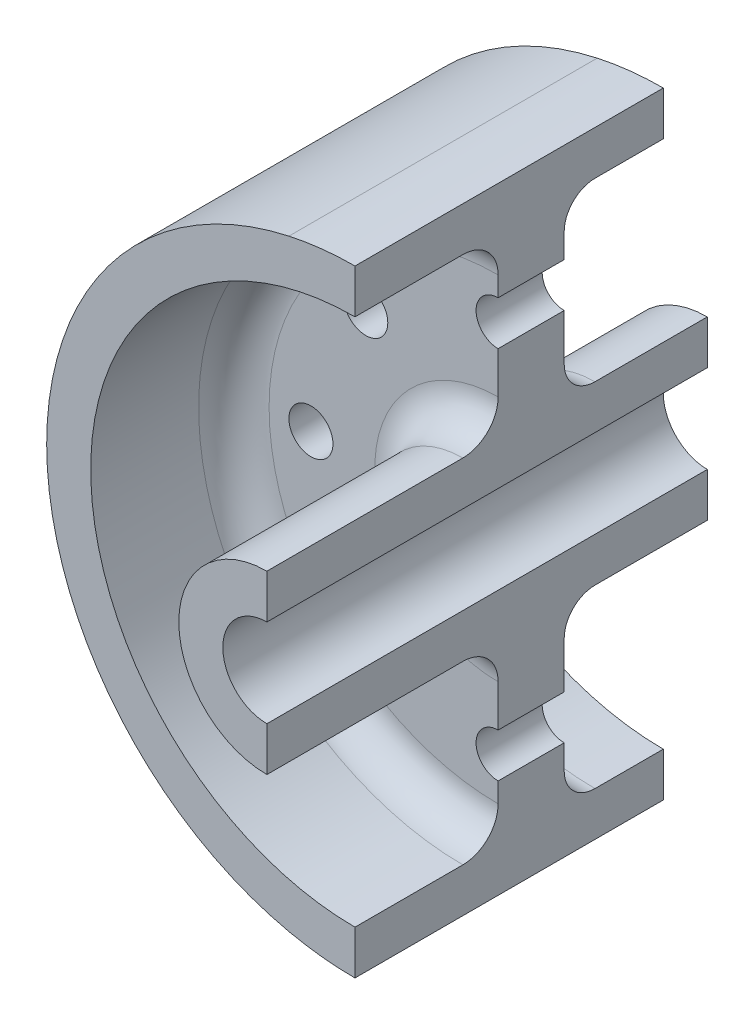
ISO-10303-21;
HEADER;
FILE_DESCRIPTION(('STEP AP214'),'2;1');
FILE_NAME('part.step','',(''),(''),'','','');
FILE_SCHEMA(('AUTOMOTIVE_DESIGN { 1 0 10303 214 1 1 1 1 }'));
ENDSEC;
DATA;
#1=APPLICATION_CONTEXT('core data for automotive mechanical design processes');
#2=APPLICATION_PROTOCOL_DEFINITION('international standard','automotive_design',2000,#1);
#3=PRODUCT_CONTEXT('',#1,'mechanical');
#4=PRODUCT('Part','Part','',(#3));
#5=PRODUCT_RELATED_PRODUCT_CATEGORY('part','',(#4));
#6=PRODUCT_DEFINITION_FORMATION('','',#4);
#7=PRODUCT_DEFINITION_CONTEXT('part definition',#1,'design');
#8=PRODUCT_DEFINITION('design','',#6,#7);
#9=PRODUCT_DEFINITION_SHAPE('','',#8);
#10=(LENGTH_UNIT() NAMED_UNIT(*) SI_UNIT(.MILLI.,.METRE.));
#11=(NAMED_UNIT(*) PLANE_ANGLE_UNIT() SI_UNIT($,.RADIAN.));
#12=(NAMED_UNIT(*) SI_UNIT($,.STERADIAN.) SOLID_ANGLE_UNIT());
#13=UNCERTAINTY_MEASURE_WITH_UNIT(LENGTH_MEASURE(1.E-05),#10,'distance_accuracy_value','');
#14=(GEOMETRIC_REPRESENTATION_CONTEXT(3) GLOBAL_UNCERTAINTY_ASSIGNED_CONTEXT((#13)) GLOBAL_UNIT_ASSIGNED_CONTEXT((#10,
#11,#12)) REPRESENTATION_CONTEXT('',''));
#15=CARTESIAN_POINT('',(0.,0.,0.));
#16=DIRECTION('',(0.,0.,1.));
#17=DIRECTION('',(1.,0.,0.));
#18=AXIS2_PLACEMENT_3D('',#15,#16,#17);
#19=CARTESIAN_POINT('',(0.,0.,0.));
#20=DIRECTION('',(0.,0.,1.));
#21=DIRECTION('',(1.,0.,0.));
#22=AXIS2_PLACEMENT_3D('',#19,#20,#21);
#23=CYLINDRICAL_SURFACE('',#22,177.8);
#24=CARTESIAN_POINT('',(0.,0.,-50.8));
#25=DIRECTION('',(0.,0.,1.));
#26=DIRECTION('',(1.,0.,0.));
#27=AXIS2_PLACEMENT_3D('',#24,#25,#26);
#28=CIRCLE('',#27,177.8);
#29=CARTESIAN_POINT('',(0.,177.8,-50.8));
#30=VERTEX_POINT('',#29);
#31=CARTESIAN_POINT('',(-38.1,173.669888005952,-50.8));
#32=VERTEX_POINT('',#31);
#33=EDGE_CURVE('E215',#30,#32,#28,.T.);
#34=ORIENTED_EDGE('',*,*,#33,.F.);
#35=DIRECTION('',(0.,0.,1.));
#36=VECTOR('',#35,1.);
#37=CARTESIAN_POINT('',(0.,177.8,0.));
#38=LINE('',#37,#36);
#39=CARTESIAN_POINT('',(0.,177.8,-228.6));
#40=VERTEX_POINT('',#39);
#41=EDGE_CURVE('E329',#30,#40,#38,.F.);
#42=ORIENTED_EDGE('',*,*,#41,.T.);
#43=CARTESIAN_POINT('',(0.,0.,-228.6));
#44=DIRECTION('',(0.,0.,1.));
#45=DIRECTION('',(1.,0.,0.));
#46=AXIS2_PLACEMENT_3D('',#43,#44,#45);
#47=CIRCLE('',#46,177.8);
#48=CARTESIAN_POINT('',(-38.1,173.669888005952,-228.6));
#49=VERTEX_POINT('',#48);
#50=EDGE_CURVE('E225',#40,#49,#47,.T.);
#51=ORIENTED_EDGE('',*,*,#50,.T.);
#52=DIRECTION('',(0.,0.,1.));
#53=VECTOR('',#52,1.);
#54=CARTESIAN_POINT('',(-38.1,173.669888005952,0.));
#55=LINE('',#54,#53);
#56=EDGE_CURVE('E284',#49,#32,#55,.T.);
#57=ORIENTED_EDGE('',*,*,#56,.T.);
#58=EDGE_LOOP('',(#34,#42,#51,#57));
#59=FACE_BOUND('',#58,.T.);
#60=ADVANCED_FACE('F36',(#59),#23,.T.);
#61=CARTESIAN_POINT('',(-38.1,-173.669888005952,-228.6));
#62=VERTEX_POINT('',#61);
#63=CARTESIAN_POINT('',(0.,-177.8,-228.6));
#64=VERTEX_POINT('',#63);
#65=EDGE_CURVE('E231',#62,#64,#47,.T.);
#66=ORIENTED_EDGE('',*,*,#65,.T.);
#67=DIRECTION('',(0.,0.,1.));
#68=VECTOR('',#67,1.);
#69=CARTESIAN_POINT('',(0.,-177.8,0.));
#70=LINE('',#69,#68);
#71=CARTESIAN_POINT('',(0.,-177.8,-50.8));
#72=VERTEX_POINT('',#71);
#73=EDGE_CURVE('E351',#64,#72,#70,.T.);
#74=ORIENTED_EDGE('',*,*,#73,.T.);
#75=CARTESIAN_POINT('',(-38.1,-173.669888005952,-50.8));
#76=VERTEX_POINT('',#75);
#77=EDGE_CURVE('E226',#76,#72,#28,.T.);
#78=ORIENTED_EDGE('',*,*,#77,.F.);
#79=DIRECTION('',(0.,0.,1.));
#80=VECTOR('',#79,1.);
#81=CARTESIAN_POINT('',(-38.1,-173.669888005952,0.));
#82=LINE('',#81,#80);
#83=EDGE_CURVE('E283',#76,#62,#82,.F.);
#84=ORIENTED_EDGE('',*,*,#83,.T.);
#85=EDGE_LOOP('',(#66,#74,#78,#84));
#86=FACE_BOUND('',#85,.T.);
#87=ADVANCED_FACE('F392',(#86),#23,.T.);
#88=ORIENTED_EDGE('',*,*,#56,.F.);
#89=EDGE_CURVE('E227',#49,#62,#47,.T.);
#90=ORIENTED_EDGE('',*,*,#89,.T.);
#91=ORIENTED_EDGE('',*,*,#83,.F.);
#92=EDGE_CURVE('E222',#32,#76,#28,.T.);
#93=ORIENTED_EDGE('',*,*,#92,.F.);
#94=EDGE_LOOP('',(#88,#90,#91,#93));
#95=FACE_BOUND('',#94,.T.);
#96=ADVANCED_FACE('F395',(#95),#23,.T.);
#97=CARTESIAN_POINT('',(0.,50.8,0.));
#98=DIRECTION('',(0.,0.,-1.));
#99=DIRECTION('',(-1.,0.,0.));
#100=AXIS2_PLACEMENT_3D('',#97,#98,#99);
#101=PLANE('',#100);
#102=CARTESIAN_POINT('',(0.,0.,0.));
#103=DIRECTION('',(0.,0.,1.));
#104=DIRECTION('',(1.,0.,0.));
#105=AXIS2_PLACEMENT_3D('',#102,#103,#104);
#106=CIRCLE('',#105,50.8);
#107=CARTESIAN_POINT('',(0.,50.8,0.));
#108=VERTEX_POINT('',#107);
#109=CARTESIAN_POINT('',(0.,-50.8,0.));
#110=VERTEX_POINT('',#109);
#111=EDGE_CURVE('E202',#108,#110,#106,.T.);
#112=ORIENTED_EDGE('',*,*,#111,.T.);
#113=DIRECTION('',(0.,-1.,0.));
#114=VECTOR('',#113,1.);
#115=CARTESIAN_POINT('',(0.,-194.939137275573,0.));
#116=LINE('',#115,#114);
#117=CARTESIAN_POINT('',(0.,-25.4,0.));
#118=VERTEX_POINT('',#117);
#119=EDGE_CURVE('E206',#118,#110,#116,.T.);
#120=ORIENTED_EDGE('',*,*,#119,.F.);
#121=CARTESIAN_POINT('',(0.,0.,0.));
#122=DIRECTION('',(0.,0.,1.));
#123=DIRECTION('',(1.,0.,0.));
#124=AXIS2_PLACEMENT_3D('',#121,#122,#123);
#125=CIRCLE('',#124,25.4);
#126=CARTESIAN_POINT('',(0.,25.4,0.));
#127=VERTEX_POINT('',#126);
#128=EDGE_CURVE('E204',#127,#118,#125,.T.);
#129=ORIENTED_EDGE('',*,*,#128,.F.);
#130=EDGE_CURVE('E187',#108,#127,#116,.T.);
#131=ORIENTED_EDGE('',*,*,#130,.F.);
#132=EDGE_LOOP('',(#112,#120,#129,#131));
#133=FACE_BOUND('',#132,.T.);
#134=ADVANCED_FACE('F200',(#133),#101,.F.);
#135=CARTESIAN_POINT('',(0.,0.,0.));
#136=DIRECTION('',(0.,0.,1.));
#137=DIRECTION('',(1.,0.,0.));
#138=AXIS2_PLACEMENT_3D('',#135,#136,#137);
#139=CYLINDRICAL_SURFACE('',#138,25.4);
#140=ORIENTED_EDGE('',*,*,#128,.T.);
#141=DIRECTION('',(0.,0.,1.));
#142=VECTOR('',#141,1.);
#143=CARTESIAN_POINT('',(0.,-25.4,0.));
#144=LINE('',#143,#142);
#145=CARTESIAN_POINT('',(0.,-25.4,-254.));
#146=VERTEX_POINT('',#145);
#147=EDGE_CURVE('E260',#118,#146,#144,.F.);
#148=ORIENTED_EDGE('',*,*,#147,.T.);
#149=CARTESIAN_POINT('',(0.,0.,-254.));
#150=DIRECTION('',(0.,0.,1.));
#151=DIRECTION('',(1.,0.,0.));
#152=AXIS2_PLACEMENT_3D('',#149,#150,#151);
#153=CIRCLE('',#152,25.4);
#154=CARTESIAN_POINT('',(0.,25.4,-254.));
#155=VERTEX_POINT('',#154);
#156=EDGE_CURVE('E237',#155,#146,#153,.T.);
#157=ORIENTED_EDGE('',*,*,#156,.F.);
#158=DIRECTION('',(0.,0.,1.));
#159=VECTOR('',#158,1.);
#160=CARTESIAN_POINT('',(0.,25.4,0.));
#161=LINE('',#160,#159);
#162=EDGE_CURVE('E360',#155,#127,#161,.T.);
#163=ORIENTED_EDGE('',*,*,#162,.T.);
#164=EDGE_LOOP('',(#140,#148,#157,#163));
#165=FACE_BOUND('',#164,.T.);
#166=ADVANCED_FACE('F408',(#165),#139,.F.);
#167=CARTESIAN_POINT('',(0.,25.4,-254.));
#168=DIRECTION('',(0.,0.,1.));
#169=DIRECTION('',(1.,0.,0.));
#170=AXIS2_PLACEMENT_3D('',#167,#168,#169);
#171=PLANE('',#170);
#172=CARTESIAN_POINT('',(0.,0.,-254.));
#173=DIRECTION('',(0.,0.,1.));
#174=DIRECTION('',(1.,0.,0.));
#175=AXIS2_PLACEMENT_3D('',#172,#173,#174);
#176=CIRCLE('',#175,50.8);
#177=CARTESIAN_POINT('',(0.,50.8,-254.));
#178=VERTEX_POINT('',#177);
#179=CARTESIAN_POINT('',(0.,-50.8,-254.));
#180=VERTEX_POINT('',#179);
#181=EDGE_CURVE('E234',#178,#180,#176,.T.);
#182=ORIENTED_EDGE('',*,*,#181,.F.);
#183=DIRECTION('',(0.,-1.,0.));
#184=VECTOR('',#183,1.);
#185=CARTESIAN_POINT('',(0.,-194.939137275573,-254.));
#186=LINE('',#185,#184);
#187=EDGE_CURVE('E447',#178,#155,#186,.T.);
#188=ORIENTED_EDGE('',*,*,#187,.T.);
#189=ORIENTED_EDGE('',*,*,#156,.T.);
#190=EDGE_CURVE('E205',#146,#180,#186,.T.);
#191=ORIENTED_EDGE('',*,*,#190,.T.);
#192=EDGE_LOOP('',(#182,#188,#189,#191));
#193=FACE_BOUND('',#192,.T.);
#194=ADVANCED_FACE('F452',(#193),#171,.F.);
#195=CARTESIAN_POINT('',(0.,0.,0.));
#196=DIRECTION('',(0.,0.,1.));
#197=DIRECTION('',(1.,0.,0.));
#198=AXIS2_PLACEMENT_3D('',#195,#196,#197);
#199=CYLINDRICAL_SURFACE('',#198,50.8);
#200=ORIENTED_EDGE('',*,*,#181,.T.);
#201=DIRECTION('',(0.,0.,1.));
#202=VECTOR('',#201,1.);
#203=CARTESIAN_POINT('',(0.,-50.8,0.));
#204=LINE('',#203,#202);
#205=CARTESIAN_POINT('',(0.,-50.8,-189.23));
#206=VERTEX_POINT('',#205);
#207=EDGE_CURVE('E300',#180,#206,#204,.T.);
#208=ORIENTED_EDGE('',*,*,#207,.T.);
#209=CARTESIAN_POINT('',(0.,0.,-189.23));
#210=DIRECTION('',(0.,0.,1.));
#211=DIRECTION('',(1.,0.,0.));
#212=AXIS2_PLACEMENT_3D('',#209,#210,#211);
#213=CIRCLE('',#212,50.8);
#214=CARTESIAN_POINT('',(0.,50.8,-189.23));
#215=VERTEX_POINT('',#214);
#216=EDGE_CURVE('E280',#206,#215,#213,.F.);
#217=ORIENTED_EDGE('',*,*,#216,.T.);
#218=DIRECTION('',(0.,0.,1.));
#219=VECTOR('',#218,1.);
#220=CARTESIAN_POINT('',(0.,50.8,0.));
#221=LINE('',#220,#219);
#222=EDGE_CURVE('E298',#215,#178,#221,.F.);
#223=ORIENTED_EDGE('',*,*,#222,.T.);
#224=EDGE_LOOP('',(#200,#208,#217,#223));
#225=FACE_BOUND('',#224,.T.);
#226=ADVANCED_FACE('F297',(#225),#199,.T.);
#227=CARTESIAN_POINT('',(0.,152.4,-171.45));
#228=DIRECTION('',(0.,0.,1.));
#229=DIRECTION('',(1.,0.,0.));
#230=AXIS2_PLACEMENT_3D('',#227,#228,#229);
#231=PLANE('',#230);
#232=CARTESIAN_POINT('',(-76.3321770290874,-76.3321770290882,-171.45));
#233=DIRECTION('',(0.,0.,1.));
#234=DIRECTION('',(1.,0.,0.));
#235=AXIS2_PLACEMENT_3D('',#232,#233,#234);
#236=CIRCLE('',#235,12.7);
#237=CARTESIAN_POINT('',(-63.6321770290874,-76.3321770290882,-171.45));
#238=VERTEX_POINT('',#237);
#239=EDGE_CURVE('E252',#238,#238,#236,.T.);
#240=ORIENTED_EDGE('',*,*,#239,.T.);
#241=EDGE_LOOP('',(#240));
#242=FACE_BOUND('',#241,.T.);
#243=CARTESIAN_POINT('',(-107.95,-3.76905628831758E-13,-171.45));
#244=DIRECTION('',(0.,0.,1.));
#245=DIRECTION('',(1.,0.,0.));
#246=AXIS2_PLACEMENT_3D('',#243,#244,#245);
#247=CIRCLE('',#246,12.7);
#248=CARTESIAN_POINT('',(-95.25,-3.76905628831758E-13,-171.45));
#249=VERTEX_POINT('',#248);
#250=EDGE_CURVE('E248',#249,#249,#247,.T.);
#251=ORIENTED_EDGE('',*,*,#250,.T.);
#252=EDGE_LOOP('',(#251));
#253=FACE_BOUND('',#252,.T.);
#254=CARTESIAN_POINT('',(-76.3321770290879,76.3321770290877,-171.45));
#255=DIRECTION('',(0.,0.,1.));
#256=DIRECTION('',(1.,0.,0.));
#257=AXIS2_PLACEMENT_3D('',#254,#255,#256);
#258=CIRCLE('',#257,12.7);
#259=CARTESIAN_POINT('',(-63.6321770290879,76.3321770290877,-171.45));
#260=VERTEX_POINT('',#259);
#261=EDGE_CURVE('E244',#260,#260,#258,.T.);
#262=ORIENTED_EDGE('',*,*,#261,.T.);
#263=EDGE_LOOP('',(#262));
#264=FACE_BOUND('',#263,.T.);
#265=CARTESIAN_POINT('',(0.,0.,-171.45));
#266=DIRECTION('',(0.,0.,1.));
#267=DIRECTION('',(1.,0.,0.));
#268=AXIS2_PLACEMENT_3D('',#265,#266,#267);
#269=CIRCLE('',#268,134.62);
#270=CARTESIAN_POINT('',(0.,-134.62,-171.45));
#271=VERTEX_POINT('',#270);
#272=CARTESIAN_POINT('',(0.,134.62,-171.45));
#273=VERTEX_POINT('',#272);
#274=EDGE_CURVE('E274',#271,#273,#269,.F.);
#275=ORIENTED_EDGE('',*,*,#274,.T.);
#276=DIRECTION('',(0.,-1.,0.));
#277=VECTOR('',#276,1.);
#278=CARTESIAN_POINT('',(0.,152.4,-171.45));
#279=LINE('',#278,#277);
#280=CARTESIAN_POINT('',(0.,120.65,-171.45));
#281=VERTEX_POINT('',#280);
#282=EDGE_CURVE('E59',#273,#281,#279,.T.);
#283=ORIENTED_EDGE('',*,*,#282,.T.);
#284=CARTESIAN_POINT('',(0.,107.95,-171.45));
#285=DIRECTION('',(0.,0.,1.));
#286=DIRECTION('',(1.,0.,0.));
#287=AXIS2_PLACEMENT_3D('',#284,#285,#286);
#288=CIRCLE('',#287,12.7);
#289=CARTESIAN_POINT('',(0.,95.25,-171.45));
#290=VERTEX_POINT('',#289);
#291=EDGE_CURVE('E212',#281,#290,#288,.T.);
#292=ORIENTED_EDGE('',*,*,#291,.T.);
#293=CARTESIAN_POINT('',(0.,68.58,-171.45));
#294=VERTEX_POINT('',#293);
#295=EDGE_CURVE('E310',#290,#294,#279,.T.);
#296=ORIENTED_EDGE('',*,*,#295,.T.);
#297=CARTESIAN_POINT('',(0.,0.,-171.45));
#298=DIRECTION('',(0.,0.,1.));
#299=DIRECTION('',(1.,0.,0.));
#300=AXIS2_PLACEMENT_3D('',#297,#298,#299);
#301=CIRCLE('',#300,68.58);
#302=CARTESIAN_POINT('',(0.,-68.58,-171.45));
#303=VERTEX_POINT('',#302);
#304=EDGE_CURVE('E277',#294,#303,#301,.T.);
#305=ORIENTED_EDGE('',*,*,#304,.T.);
#306=CARTESIAN_POINT('',(0.,-95.25,-171.45));
#307=VERTEX_POINT('',#306);
#308=EDGE_CURVE('E195',#303,#307,#279,.T.);
#309=ORIENTED_EDGE('',*,*,#308,.T.);
#310=CARTESIAN_POINT('',(7.53811257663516E-13,-107.95,-171.45));
#311=DIRECTION('',(0.,0.,1.));
#312=DIRECTION('',(1.,0.,0.));
#313=AXIS2_PLACEMENT_3D('',#310,#311,#312);
#314=CIRCLE('',#313,12.7);
#315=CARTESIAN_POINT('',(0.,-120.65,-171.45));
#316=VERTEX_POINT('',#315);
#317=EDGE_CURVE('E256',#307,#316,#314,.T.);
#318=ORIENTED_EDGE('',*,*,#317,.T.);
#319=EDGE_CURVE('E346',#316,#271,#279,.T.);
#320=ORIENTED_EDGE('',*,*,#319,.T.);
#321=EDGE_LOOP('',(#275,#283,#292,#296,#305,#309,#318,#320));
#322=FACE_BOUND('',#321,.T.);
#323=ADVANCED_FACE('F372',(#242,#253,#264,#322),#231,.F.);
#324=CARTESIAN_POINT('',(0.,0.,0.));
#325=DIRECTION('',(0.,0.,1.));
#326=DIRECTION('',(1.,0.,0.));
#327=AXIS2_PLACEMENT_3D('',#324,#325,#326);
#328=CYLINDRICAL_SURFACE('',#327,152.4);
#329=CARTESIAN_POINT('',(0.,0.,-189.23));
#330=DIRECTION('',(0.,0.,1.));
#331=DIRECTION('',(1.,0.,0.));
#332=AXIS2_PLACEMENT_3D('',#329,#330,#331);
#333=CIRCLE('',#332,152.4);
#334=CARTESIAN_POINT('',(0.,152.4,-189.23));
#335=VERTEX_POINT('',#334);
#336=CARTESIAN_POINT('',(0.,-152.4,-189.23));
#337=VERTEX_POINT('',#336);
#338=EDGE_CURVE('E271',#335,#337,#333,.T.);
#339=ORIENTED_EDGE('',*,*,#338,.T.);
#340=DIRECTION('',(0.,0.,1.));
#341=VECTOR('',#340,1.);
#342=CARTESIAN_POINT('',(0.,-152.4,0.));
#343=LINE('',#342,#341);
#344=CARTESIAN_POINT('',(0.,-152.4,-228.6));
#345=VERTEX_POINT('',#344);
#346=EDGE_CURVE('E51',#337,#345,#343,.F.);
#347=ORIENTED_EDGE('',*,*,#346,.T.);
#348=CARTESIAN_POINT('',(0.,0.,-228.6));
#349=DIRECTION('',(0.,0.,1.));
#350=DIRECTION('',(1.,0.,0.));
#351=AXIS2_PLACEMENT_3D('',#348,#349,#350);
#352=CIRCLE('',#351,152.4);
#353=CARTESIAN_POINT('',(0.,152.4,-228.6));
#354=VERTEX_POINT('',#353);
#355=EDGE_CURVE('E230',#354,#345,#352,.T.);
#356=ORIENTED_EDGE('',*,*,#355,.F.);
#357=DIRECTION('',(0.,0.,1.));
#358=VECTOR('',#357,1.);
#359=CARTESIAN_POINT('',(0.,152.4,0.));
#360=LINE('',#359,#358);
#361=EDGE_CURVE('E319',#354,#335,#360,.T.);
#362=ORIENTED_EDGE('',*,*,#361,.T.);
#363=EDGE_LOOP('',(#339,#347,#356,#362));
#364=FACE_BOUND('',#363,.T.);
#365=ADVANCED_FACE('F468',(#364),#328,.F.);
#366=CARTESIAN_POINT('',(0.,177.8,-228.6));
#367=DIRECTION('',(0.,0.,1.));
#368=DIRECTION('',(1.,0.,0.));
#369=AXIS2_PLACEMENT_3D('',#366,#367,#368);
#370=PLANE('',#369);
#371=ORIENTED_EDGE('',*,*,#50,.F.);
#372=DIRECTION('',(0.,-1.,0.));
#373=VECTOR('',#372,1.);
#374=CARTESIAN_POINT('',(0.,177.8,-228.6));
#375=LINE('',#374,#373);
#376=EDGE_CURVE('E326',#40,#354,#375,.T.);
#377=ORIENTED_EDGE('',*,*,#376,.T.);
#378=ORIENTED_EDGE('',*,*,#355,.T.);
#379=EDGE_CURVE('E330',#345,#64,#375,.T.);
#380=ORIENTED_EDGE('',*,*,#379,.T.);
#381=ORIENTED_EDGE('',*,*,#65,.F.);
#382=ORIENTED_EDGE('',*,*,#89,.F.);
#383=EDGE_LOOP('',(#371,#377,#378,#380,#381,#382));
#384=FACE_BOUND('',#383,.T.);
#385=ADVANCED_FACE('F416',(#384),#370,.F.);
#386=CARTESIAN_POINT('',(0.,152.4,-50.8));
#387=DIRECTION('',(0.,0.,-1.));
#388=DIRECTION('',(-1.,0.,0.));
#389=AXIS2_PLACEMENT_3D('',#386,#387,#388);
#390=PLANE('',#389);
#391=ORIENTED_EDGE('',*,*,#77,.T.);
#392=DIRECTION('',(0.,1.,0.));
#393=VECTOR('',#392,1.);
#394=CARTESIAN_POINT('',(0.,152.4,-50.8));
#395=LINE('',#394,#393);
#396=CARTESIAN_POINT('',(0.,-152.4,-50.8));
#397=VERTEX_POINT('',#396);
#398=EDGE_CURVE('E343',#72,#397,#395,.T.);
#399=ORIENTED_EDGE('',*,*,#398,.T.);
#400=CARTESIAN_POINT('',(0.,0.,-50.8));
#401=DIRECTION('',(0.,0.,1.));
#402=DIRECTION('',(1.,0.,0.));
#403=AXIS2_PLACEMENT_3D('',#400,#401,#402);
#404=CIRCLE('',#403,152.4);
#405=CARTESIAN_POINT('',(0.,152.4,-50.8));
#406=VERTEX_POINT('',#405);
#407=EDGE_CURVE('E211',#406,#397,#404,.T.);
#408=ORIENTED_EDGE('',*,*,#407,.F.);
#409=EDGE_CURVE('E339',#406,#30,#395,.T.);
#410=ORIENTED_EDGE('',*,*,#409,.T.);
#411=ORIENTED_EDGE('',*,*,#33,.T.);
#412=ORIENTED_EDGE('',*,*,#92,.T.);
#413=EDGE_LOOP('',(#391,#399,#408,#410,#411,#412));
#414=FACE_BOUND('',#413,.T.);
#415=ADVANCED_FACE('F423',(#414),#390,.F.);
#416=CARTESIAN_POINT('',(0.,0.,0.));
#417=DIRECTION('',(0.,0.,1.));
#418=DIRECTION('',(1.,0.,0.));
#419=AXIS2_PLACEMENT_3D('',#416,#417,#418);
#420=CYLINDRICAL_SURFACE('',#419,152.4);
#421=ORIENTED_EDGE('',*,*,#407,.T.);
#422=DIRECTION('',(0.,0.,1.));
#423=VECTOR('',#422,1.);
#424=CARTESIAN_POINT('',(0.,-152.4,0.));
#425=LINE('',#424,#423);
#426=CARTESIAN_POINT('',(0.,-152.4,-113.03));
#427=VERTEX_POINT('',#426);
#428=EDGE_CURVE('E357',#397,#427,#425,.F.);
#429=ORIENTED_EDGE('',*,*,#428,.T.);
#430=CARTESIAN_POINT('',(0.,0.,-113.03));
#431=DIRECTION('',(0.,0.,-1.));
#432=DIRECTION('',(-1.,0.,0.));
#433=AXIS2_PLACEMENT_3D('',#430,#431,#432);
#434=CIRCLE('',#433,152.4);
#435=CARTESIAN_POINT('',(0.,152.4,-113.03));
#436=VERTEX_POINT('',#435);
#437=EDGE_CURVE('E263',#427,#436,#434,.T.);
#438=ORIENTED_EDGE('',*,*,#437,.T.);
#439=DIRECTION('',(0.,0.,1.));
#440=VECTOR('',#439,1.);
#441=CARTESIAN_POINT('',(0.,152.4,0.));
#442=LINE('',#441,#440);
#443=EDGE_CURVE('E336',#436,#406,#442,.T.);
#444=ORIENTED_EDGE('',*,*,#443,.T.);
#445=EDGE_LOOP('',(#421,#429,#438,#444));
#446=FACE_BOUND('',#445,.T.);
#447=ADVANCED_FACE('F426',(#446),#420,.F.);
#448=CARTESIAN_POINT('',(0.,50.8,-133.35));
#449=DIRECTION('',(0.,0.,-1.));
#450=DIRECTION('',(-1.,0.,0.));
#451=AXIS2_PLACEMENT_3D('',#448,#449,#450);
#452=PLANE('',#451);
#453=CARTESIAN_POINT('',(0.,0.,-133.35));
#454=DIRECTION('',(0.,0.,-1.));
#455=DIRECTION('',(-1.,0.,0.));
#456=AXIS2_PLACEMENT_3D('',#453,#454,#455);
#457=CIRCLE('',#456,132.08);
#458=CARTESIAN_POINT('',(0.,132.08,-133.35));
#459=VERTEX_POINT('',#458);
#460=CARTESIAN_POINT('',(0.,-132.08,-133.35));
#461=VERTEX_POINT('',#460);
#462=EDGE_CURVE('E241',#459,#461,#457,.F.);
#463=ORIENTED_EDGE('',*,*,#462,.T.);
#464=DIRECTION('',(0.,1.,0.));
#465=VECTOR('',#464,1.);
#466=CARTESIAN_POINT('',(0.,50.8,-133.35));
#467=LINE('',#466,#465);
#468=CARTESIAN_POINT('',(0.,-120.65,-133.35));
#469=VERTEX_POINT('',#468);
#470=EDGE_CURVE('E350',#461,#469,#467,.T.);
#471=ORIENTED_EDGE('',*,*,#470,.T.);
#472=CARTESIAN_POINT('',(7.53811257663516E-13,-107.95,-133.35));
#473=DIRECTION('',(0.,0.,-1.));
#474=DIRECTION('',(-1.,0.,0.));
#475=AXIS2_PLACEMENT_3D('',#472,#473,#474);
#476=CIRCLE('',#475,12.7);
#477=CARTESIAN_POINT('',(0.,-95.25,-133.35));
#478=VERTEX_POINT('',#477);
#479=EDGE_CURVE('E257',#469,#478,#476,.T.);
#480=ORIENTED_EDGE('',*,*,#479,.T.);
#481=CARTESIAN_POINT('',(0.,-71.12,-133.35));
#482=VERTEX_POINT('',#481);
#483=EDGE_CURVE('E306',#478,#482,#467,.T.);
#484=ORIENTED_EDGE('',*,*,#483,.T.);
#485=CARTESIAN_POINT('',(0.,0.,-133.35));
#486=DIRECTION('',(0.,0.,-1.));
#487=DIRECTION('',(-1.,0.,0.));
#488=AXIS2_PLACEMENT_3D('',#485,#486,#487);
#489=CIRCLE('',#488,71.12);
#490=CARTESIAN_POINT('',(0.,71.12,-133.35));
#491=VERTEX_POINT('',#490);
#492=EDGE_CURVE('E268',#482,#491,#489,.T.);
#493=ORIENTED_EDGE('',*,*,#492,.T.);
#494=CARTESIAN_POINT('',(0.,95.25,-133.35));
#495=VERTEX_POINT('',#494);
#496=EDGE_CURVE('E440',#491,#495,#467,.T.);
#497=ORIENTED_EDGE('',*,*,#496,.T.);
#498=CARTESIAN_POINT('',(0.,107.95,-133.35));
#499=DIRECTION('',(0.,0.,-1.));
#500=DIRECTION('',(-1.,0.,0.));
#501=AXIS2_PLACEMENT_3D('',#498,#499,#500);
#502=CIRCLE('',#501,12.7);
#503=CARTESIAN_POINT('',(0.,120.65,-133.35));
#504=VERTEX_POINT('',#503);
#505=EDGE_CURVE('E218',#495,#504,#502,.T.);
#506=ORIENTED_EDGE('',*,*,#505,.T.);
#507=EDGE_CURVE('E325',#504,#459,#467,.T.);
#508=ORIENTED_EDGE('',*,*,#507,.T.);
#509=EDGE_LOOP('',(#463,#471,#480,#484,#493,#497,#506,#508));
#510=FACE_BOUND('',#509,.T.);
#511=CARTESIAN_POINT('',(-76.3321770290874,-76.3321770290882,-133.35));
#512=DIRECTION('',(0.,0.,-1.));
#513=DIRECTION('',(-1.,0.,0.));
#514=AXIS2_PLACEMENT_3D('',#511,#512,#513);
#515=CIRCLE('',#514,12.7);
#516=CARTESIAN_POINT('',(-89.0321770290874,-76.3321770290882,-133.35));
#517=VERTEX_POINT('',#516);
#518=EDGE_CURVE('E253',#517,#517,#515,.T.);
#519=ORIENTED_EDGE('',*,*,#518,.T.);
#520=EDGE_LOOP('',(#519));
#521=FACE_BOUND('',#520,.T.);
#522=CARTESIAN_POINT('',(-107.95,-3.76905628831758E-13,-133.35));
#523=DIRECTION('',(0.,0.,-1.));
#524=DIRECTION('',(-1.,0.,0.));
#525=AXIS2_PLACEMENT_3D('',#522,#523,#524);
#526=CIRCLE('',#525,12.7);
#527=CARTESIAN_POINT('',(-120.65,-3.76905628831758E-13,-133.35));
#528=VERTEX_POINT('',#527);
#529=EDGE_CURVE('E249',#528,#528,#526,.T.);
#530=ORIENTED_EDGE('',*,*,#529,.T.);
#531=EDGE_LOOP('',(#530));
#532=FACE_BOUND('',#531,.T.);
#533=CARTESIAN_POINT('',(-76.3321770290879,76.3321770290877,-133.35));
#534=DIRECTION('',(0.,0.,-1.));
#535=DIRECTION('',(-1.,0.,0.));
#536=AXIS2_PLACEMENT_3D('',#533,#534,#535);
#537=CIRCLE('',#536,12.7);
#538=CARTESIAN_POINT('',(-89.0321770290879,76.3321770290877,-133.35));
#539=VERTEX_POINT('',#538);
#540=EDGE_CURVE('E245',#539,#539,#537,.T.);
#541=ORIENTED_EDGE('',*,*,#540,.T.);
#542=EDGE_LOOP('',(#541));
#543=FACE_BOUND('',#542,.T.);
#544=ADVANCED_FACE('F434',(#510,#521,#532,#543),#452,.F.);
#545=CARTESIAN_POINT('',(0.,0.,0.));
#546=DIRECTION('',(0.,0.,1.));
#547=DIRECTION('',(1.,0.,0.));
#548=AXIS2_PLACEMENT_3D('',#545,#546,#547);
#549=CYLINDRICAL_SURFACE('',#548,50.8);
#550=CARTESIAN_POINT('',(0.,0.,-113.03));
#551=DIRECTION('',(0.,0.,-1.));
#552=DIRECTION('',(-1.,0.,0.));
#553=AXIS2_PLACEMENT_3D('',#550,#551,#552);
#554=CIRCLE('',#553,50.8);
#555=CARTESIAN_POINT('',(0.,50.8,-113.03));
#556=VERTEX_POINT('',#555);
#557=CARTESIAN_POINT('',(0.,-50.8,-113.03));
#558=VERTEX_POINT('',#557);
#559=EDGE_CURVE('E266',#556,#558,#554,.F.);
#560=ORIENTED_EDGE('',*,*,#559,.T.);
#561=DIRECTION('',(0.,0.,1.));
#562=VECTOR('',#561,1.);
#563=CARTESIAN_POINT('',(0.,-50.8,0.));
#564=LINE('',#563,#562);
#565=EDGE_CURVE('E210',#558,#110,#564,.T.);
#566=ORIENTED_EDGE('',*,*,#565,.T.);
#567=ORIENTED_EDGE('',*,*,#111,.F.);
#568=DIRECTION('',(0.,0.,1.));
#569=VECTOR('',#568,1.);
#570=CARTESIAN_POINT('',(0.,50.8,0.));
#571=LINE('',#570,#569);
#572=EDGE_CURVE('E184',#108,#556,#571,.F.);
#573=ORIENTED_EDGE('',*,*,#572,.T.);
#574=EDGE_LOOP('',(#560,#566,#567,#573));
#575=FACE_BOUND('',#574,.T.);
#576=ADVANCED_FACE('F209',(#575),#549,.T.);
#577=CARTESIAN_POINT('',(0.,107.95,-254.));
#578=DIRECTION('',(0.,0.,1.));
#579=DIRECTION('',(1.,0.,0.));
#580=AXIS2_PLACEMENT_3D('',#577,#578,#579);
#581=CYLINDRICAL_SURFACE('',#580,12.7);
#582=ORIENTED_EDGE('',*,*,#505,.F.);
#583=DIRECTION('',(0.,0.,1.));
#584=VECTOR('',#583,1.);
#585=CARTESIAN_POINT('',(0.,95.25,-254.));
#586=LINE('',#585,#584);
#587=EDGE_CURVE('E443',#495,#290,#586,.F.);
#588=ORIENTED_EDGE('',*,*,#587,.T.);
#589=ORIENTED_EDGE('',*,*,#291,.F.);
#590=DIRECTION('',(0.,0.,1.));
#591=VECTOR('',#590,1.);
#592=CARTESIAN_POINT('',(0.,120.65,-254.));
#593=LINE('',#592,#591);
#594=EDGE_CURVE('E322',#281,#504,#593,.T.);
#595=ORIENTED_EDGE('',*,*,#594,.T.);
#596=EDGE_LOOP('',(#582,#588,#589,#595));
#597=FACE_BOUND('',#596,.T.);
#598=ADVANCED_FACE('F378',(#597),#581,.F.);
#599=CARTESIAN_POINT('',(-76.3321770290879,76.3321770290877,-254.));
#600=DIRECTION('',(0.,0.,1.));
#601=DIRECTION('',(1.,0.,0.));
#602=AXIS2_PLACEMENT_3D('',#599,#600,#601);
#603=CYLINDRICAL_SURFACE('',#602,12.7);
#604=ORIENTED_EDGE('',*,*,#540,.F.);
#605=EDGE_LOOP('',(#604));
#606=FACE_BOUND('',#605,.T.);
#607=ORIENTED_EDGE('',*,*,#261,.F.);
#608=EDGE_LOOP('',(#607));
#609=FACE_BOUND('',#608,.T.);
#610=ADVANCED_FACE('F375',(#606,#609),#603,.F.);
#611=CARTESIAN_POINT('',(-107.95,-3.76905628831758E-13,-254.));
#612=DIRECTION('',(0.,0.,1.));
#613=DIRECTION('',(1.,0.,0.));
#614=AXIS2_PLACEMENT_3D('',#611,#612,#613);
#615=CYLINDRICAL_SURFACE('',#614,12.7);
#616=ORIENTED_EDGE('',*,*,#529,.F.);
#617=EDGE_LOOP('',(#616));
#618=FACE_BOUND('',#617,.T.);
#619=ORIENTED_EDGE('',*,*,#250,.F.);
#620=EDGE_LOOP('',(#619));
#621=FACE_BOUND('',#620,.T.);
#622=ADVANCED_FACE('F377',(#618,#621),#615,.F.);
#623=CARTESIAN_POINT('',(-76.3321770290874,-76.3321770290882,-254.));
#624=DIRECTION('',(0.,0.,1.));
#625=DIRECTION('',(1.,0.,0.));
#626=AXIS2_PLACEMENT_3D('',#623,#624,#625);
#627=CYLINDRICAL_SURFACE('',#626,12.7);
#628=ORIENTED_EDGE('',*,*,#518,.F.);
#629=EDGE_LOOP('',(#628));
#630=FACE_BOUND('',#629,.T.);
#631=ORIENTED_EDGE('',*,*,#239,.F.);
#632=EDGE_LOOP('',(#631));
#633=FACE_BOUND('',#632,.T.);
#634=ADVANCED_FACE('F385',(#630,#633),#627,.F.);
#635=CARTESIAN_POINT('',(7.53811257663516E-13,-107.95,-254.));
#636=DIRECTION('',(0.,0.,1.));
#637=DIRECTION('',(1.,0.,0.));
#638=AXIS2_PLACEMENT_3D('',#635,#636,#637);
#639=CYLINDRICAL_SURFACE('',#638,12.7);
#640=ORIENTED_EDGE('',*,*,#479,.F.);
#641=DIRECTION('',(0.,0.,1.));
#642=VECTOR('',#641,1.);
#643=CARTESIAN_POINT('',(0.,-120.65,-254.));
#644=LINE('',#643,#642);
#645=EDGE_CURVE('E347',#469,#316,#644,.F.);
#646=ORIENTED_EDGE('',*,*,#645,.T.);
#647=ORIENTED_EDGE('',*,*,#317,.F.);
#648=DIRECTION('',(0.,0.,1.));
#649=VECTOR('',#648,1.);
#650=CARTESIAN_POINT('',(0.,-95.25,-254.));
#651=LINE('',#650,#649);
#652=EDGE_CURVE('E303',#307,#478,#651,.T.);
#653=ORIENTED_EDGE('',*,*,#652,.T.);
#654=EDGE_LOOP('',(#640,#646,#647,#653));
#655=FACE_BOUND('',#654,.T.);
#656=ADVANCED_FACE('F460',(#655),#639,.F.);
#657=CARTESIAN_POINT('',(0.,0.,-113.03));
#658=DIRECTION('',(0.,0.,-1.));
#659=DIRECTION('',(-1.,0.,0.));
#660=AXIS2_PLACEMENT_3D('',#657,#658,#659);
#661=TOROIDAL_SURFACE('',#660,132.08,20.32);
#662=ORIENTED_EDGE('',*,*,#462,.F.);
#663=CARTESIAN_POINT('',(0.,132.08,-113.03));
#664=DIRECTION('',(-1.,0.,0.));
#665=DIRECTION('',(0.,0.,1.));
#666=AXIS2_PLACEMENT_3D('',#663,#664,#665);
#667=CIRCLE('',#666,20.32);
#668=EDGE_CURVE('E333',#459,#436,#667,.F.);
#669=ORIENTED_EDGE('',*,*,#668,.T.);
#670=ORIENTED_EDGE('',*,*,#437,.F.);
#671=CARTESIAN_POINT('',(0.,-132.08,-113.03));
#672=DIRECTION('',(-1.,0.,0.));
#673=DIRECTION('',(0.,0.,1.));
#674=AXIS2_PLACEMENT_3D('',#671,#672,#673);
#675=CIRCLE('',#674,20.32);
#676=EDGE_CURVE('E354',#427,#461,#675,.F.);
#677=ORIENTED_EDGE('',*,*,#676,.T.);
#678=EDGE_LOOP('',(#662,#669,#670,#677));
#679=FACE_BOUND('',#678,.T.);
#680=ADVANCED_FACE('F431',(#679),#661,.F.);
#681=CARTESIAN_POINT('',(0.,0.,-113.03));
#682=DIRECTION('',(0.,0.,-1.));
#683=DIRECTION('',(-1.,0.,0.));
#684=AXIS2_PLACEMENT_3D('',#681,#682,#683);
#685=TOROIDAL_SURFACE('',#684,71.12,20.32);
#686=ORIENTED_EDGE('',*,*,#559,.F.);
#687=CARTESIAN_POINT('',(0.,71.12,-113.03));
#688=DIRECTION('',(-1.,0.,0.));
#689=DIRECTION('',(0.,0.,1.));
#690=AXIS2_PLACEMENT_3D('',#687,#688,#689);
#691=CIRCLE('',#690,20.32);
#692=EDGE_CURVE('E190',#556,#491,#691,.F.);
#693=ORIENTED_EDGE('',*,*,#692,.T.);
#694=ORIENTED_EDGE('',*,*,#492,.F.);
#695=CARTESIAN_POINT('',(0.,-71.12,-113.03));
#696=DIRECTION('',(-1.,0.,0.));
#697=DIRECTION('',(0.,0.,1.));
#698=AXIS2_PLACEMENT_3D('',#695,#696,#697);
#699=CIRCLE('',#698,20.32);
#700=EDGE_CURVE('E313',#482,#558,#699,.F.);
#701=ORIENTED_EDGE('',*,*,#700,.T.);
#702=EDGE_LOOP('',(#686,#693,#694,#701));
#703=FACE_BOUND('',#702,.T.);
#704=ADVANCED_FACE('F457',(#703),#685,.F.);
#705=CARTESIAN_POINT('',(0.,0.,-189.23));
#706=DIRECTION('',(0.,0.,1.));
#707=DIRECTION('',(1.,0.,0.));
#708=AXIS2_PLACEMENT_3D('',#705,#706,#707);
#709=TOROIDAL_SURFACE('',#708,134.62,17.78);
#710=ORIENTED_EDGE('',*,*,#274,.F.);
#711=CARTESIAN_POINT('',(0.,-134.62,-189.23));
#712=DIRECTION('',(-1.,0.,0.));
#713=DIRECTION('',(0.,0.,1.));
#714=AXIS2_PLACEMENT_3D('',#711,#712,#713);
#715=CIRCLE('',#714,17.78);
#716=EDGE_CURVE('E342',#271,#337,#715,.F.);
#717=ORIENTED_EDGE('',*,*,#716,.T.);
#718=ORIENTED_EDGE('',*,*,#338,.F.);
#719=CARTESIAN_POINT('',(0.,134.62,-189.23));
#720=DIRECTION('',(-1.,0.,0.));
#721=DIRECTION('',(0.,0.,1.));
#722=AXIS2_PLACEMENT_3D('',#719,#720,#721);
#723=CIRCLE('',#722,17.78);
#724=EDGE_CURVE('E317',#335,#273,#723,.F.);
#725=ORIENTED_EDGE('',*,*,#724,.T.);
#726=EDGE_LOOP('',(#710,#717,#718,#725));
#727=FACE_BOUND('',#726,.T.);
#728=ADVANCED_FACE('F464',(#727),#709,.F.);
#729=CARTESIAN_POINT('',(0.,0.,-189.23));
#730=DIRECTION('',(0.,0.,1.));
#731=DIRECTION('',(1.,0.,0.));
#732=AXIS2_PLACEMENT_3D('',#729,#730,#731);
#733=TOROIDAL_SURFACE('',#732,68.58,17.78);
#734=ORIENTED_EDGE('',*,*,#216,.F.);
#735=CARTESIAN_POINT('',(0.,-68.58,-189.23));
#736=DIRECTION('',(-1.,0.,0.));
#737=DIRECTION('',(0.,0.,1.));
#738=AXIS2_PLACEMENT_3D('',#735,#736,#737);
#739=CIRCLE('',#738,17.78);
#740=EDGE_CURVE('E11',#206,#303,#739,.F.);
#741=ORIENTED_EDGE('',*,*,#740,.T.);
#742=ORIENTED_EDGE('',*,*,#304,.F.);
#743=CARTESIAN_POINT('',(0.,68.58,-189.23));
#744=DIRECTION('',(-1.,0.,0.));
#745=DIRECTION('',(0.,0.,1.));
#746=AXIS2_PLACEMENT_3D('',#743,#744,#745);
#747=CIRCLE('',#746,17.78);
#748=EDGE_CURVE('E44',#294,#215,#747,.F.);
#749=ORIENTED_EDGE('',*,*,#748,.T.);
#750=EDGE_LOOP('',(#734,#741,#742,#749));
#751=FACE_BOUND('',#750,.T.);
#752=ADVANCED_FACE('F38',(#751),#733,.F.);
#753=CARTESIAN_POINT('',(0.,-194.939137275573,-254.));
#754=DIRECTION('',(-1.,0.,0.));
#755=DIRECTION('',(0.,0.,1.));
#756=AXIS2_PLACEMENT_3D('',#753,#754,#755);
#757=PLANE('',#756);
#758=ORIENTED_EDGE('',*,*,#187,.F.);
#759=ORIENTED_EDGE('',*,*,#222,.F.);
#760=ORIENTED_EDGE('',*,*,#748,.F.);
#761=ORIENTED_EDGE('',*,*,#295,.F.);
#762=ORIENTED_EDGE('',*,*,#587,.F.);
#763=ORIENTED_EDGE('',*,*,#496,.F.);
#764=ORIENTED_EDGE('',*,*,#692,.F.);
#765=ORIENTED_EDGE('',*,*,#572,.F.);
#766=ORIENTED_EDGE('',*,*,#130,.T.);
#767=ORIENTED_EDGE('',*,*,#162,.F.);
#768=EDGE_LOOP('',(#758,#759,#760,#761,#762,#763,#764,#765,#766,#767));
#769=FACE_BOUND('',#768,.T.);
#770=ADVANCED_FACE('F186',(#769),#757,.F.);
#771=ORIENTED_EDGE('',*,*,#119,.T.);
#772=ORIENTED_EDGE('',*,*,#565,.F.);
#773=ORIENTED_EDGE('',*,*,#700,.F.);
#774=ORIENTED_EDGE('',*,*,#483,.F.);
#775=ORIENTED_EDGE('',*,*,#652,.F.);
#776=ORIENTED_EDGE('',*,*,#308,.F.);
#777=ORIENTED_EDGE('',*,*,#740,.F.);
#778=ORIENTED_EDGE('',*,*,#207,.F.);
#779=ORIENTED_EDGE('',*,*,#190,.F.);
#780=ORIENTED_EDGE('',*,*,#147,.F.);
#781=EDGE_LOOP('',(#771,#772,#773,#774,#775,#776,#777,#778,#779,#780));
#782=FACE_BOUND('',#781,.T.);
#783=ADVANCED_FACE('F454',(#782),#757,.F.);
#784=ORIENTED_EDGE('',*,*,#443,.F.);
#785=ORIENTED_EDGE('',*,*,#668,.F.);
#786=ORIENTED_EDGE('',*,*,#507,.F.);
#787=ORIENTED_EDGE('',*,*,#594,.F.);
#788=ORIENTED_EDGE('',*,*,#282,.F.);
#789=ORIENTED_EDGE('',*,*,#724,.F.);
#790=ORIENTED_EDGE('',*,*,#361,.F.);
#791=ORIENTED_EDGE('',*,*,#376,.F.);
#792=ORIENTED_EDGE('',*,*,#41,.F.);
#793=ORIENTED_EDGE('',*,*,#409,.F.);
#794=EDGE_LOOP('',(#784,#785,#786,#787,#788,#789,#790,#791,#792,#793));
#795=FACE_BOUND('',#794,.T.);
#796=ADVANCED_FACE('F419',(#795),#757,.F.);
#797=ORIENTED_EDGE('',*,*,#73,.F.);
#798=ORIENTED_EDGE('',*,*,#379,.F.);
#799=ORIENTED_EDGE('',*,*,#346,.F.);
#800=ORIENTED_EDGE('',*,*,#716,.F.);
#801=ORIENTED_EDGE('',*,*,#319,.F.);
#802=ORIENTED_EDGE('',*,*,#645,.F.);
#803=ORIENTED_EDGE('',*,*,#470,.F.);
#804=ORIENTED_EDGE('',*,*,#676,.F.);
#805=ORIENTED_EDGE('',*,*,#428,.F.);
#806=ORIENTED_EDGE('',*,*,#398,.F.);
#807=EDGE_LOOP('',(#797,#798,#799,#800,#801,#802,#803,#804,#805,#806));
#808=FACE_BOUND('',#807,.T.);
#809=ADVANCED_FACE('F495',(#808),#757,.F.);
#810=CLOSED_SHELL('',(#60,#87,#96,#134,#166,#194,#226,#323,#365,#385,#415,#447,#544,#576,#598,
#610,#622,#634,#656,#680,#704,#728,#752,#770,#783,#796,#809));
#811=MANIFOLD_SOLID_BREP('B2',#810);
#812=ADVANCED_BREP_SHAPE_REPRESENTATION('',(#18,#811),#14);
#813=SHAPE_DEFINITION_REPRESENTATION(#9,#812);
ENDSEC;
END-ISO-10303-21;
